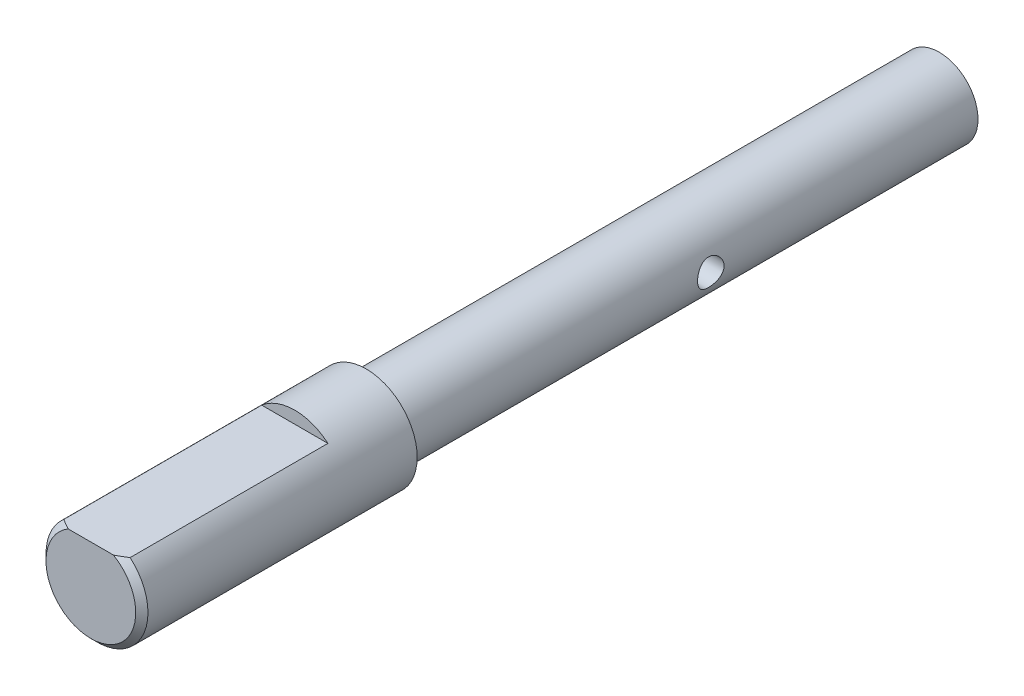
ISO-10303-21;
HEADER;
FILE_DESCRIPTION(('STEP AP214'),'2;1');
FILE_NAME('part.step','',(''),(''),'','','');
FILE_SCHEMA(('AUTOMOTIVE_DESIGN { 1 0 10303 214 1 1 1 1 }'));
ENDSEC;
DATA;
#1=APPLICATION_CONTEXT('core data for automotive mechanical design processes');
#2=APPLICATION_PROTOCOL_DEFINITION('international standard','automotive_design',2000,#1);
#3=PRODUCT_CONTEXT('',#1,'mechanical');
#4=PRODUCT('Part','Part','',(#3));
#5=PRODUCT_RELATED_PRODUCT_CATEGORY('part','',(#4));
#6=PRODUCT_DEFINITION_FORMATION('','',#4);
#7=PRODUCT_DEFINITION_CONTEXT('part definition',#1,'design');
#8=PRODUCT_DEFINITION('design','',#6,#7);
#9=PRODUCT_DEFINITION_SHAPE('','',#8);
#10=(LENGTH_UNIT() NAMED_UNIT(*) SI_UNIT(.MILLI.,.METRE.));
#11=(NAMED_UNIT(*) PLANE_ANGLE_UNIT() SI_UNIT($,.RADIAN.));
#12=(NAMED_UNIT(*) SI_UNIT($,.STERADIAN.) SOLID_ANGLE_UNIT());
#13=UNCERTAINTY_MEASURE_WITH_UNIT(LENGTH_MEASURE(1.E-05),#10,'distance_accuracy_value','');
#14=(GEOMETRIC_REPRESENTATION_CONTEXT(3) GLOBAL_UNCERTAINTY_ASSIGNED_CONTEXT((#13)) GLOBAL_UNIT_ASSIGNED_CONTEXT((#10,
#11,#12)) REPRESENTATION_CONTEXT('',''));
#15=CARTESIAN_POINT('',(0.,0.,0.));
#16=DIRECTION('',(0.,0.,1.));
#17=DIRECTION('',(1.,0.,0.));
#18=AXIS2_PLACEMENT_3D('',#15,#16,#17);
#19=CARTESIAN_POINT('',(0.,0.,71.374));
#20=DIRECTION('',(0.,0.,-1.));
#21=DIRECTION('',(-1.,0.,0.));
#22=AXIS2_PLACEMENT_3D('',#19,#20,#21);
#23=CYLINDRICAL_SURFACE('',#22,4.826);
#24=CARTESIAN_POINT('',(-4.826,0.,34.925));
#25=CARTESIAN_POINT('',(-4.82600061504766,-0.0899483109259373,34.9250009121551));
#26=CARTESIAN_POINT('',(-4.82346234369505,-0.179890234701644,34.9176255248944));
#27=CARTESIAN_POINT('',(-4.81358738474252,-0.357116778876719,34.8884149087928));
#28=CARTESIAN_POINT('',(-4.80625044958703,-0.444401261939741,34.8665789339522));
#29=CARTESIAN_POINT('',(-4.78757345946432,-0.61373237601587,34.8092889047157));
#30=CARTESIAN_POINT('',(-4.77624031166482,-0.695787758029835,34.7738583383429));
#31=CARTESIAN_POINT('',(-4.75072192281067,-0.852790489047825,34.6904937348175));
#32=CARTESIAN_POINT('',(-4.73653607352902,-0.92773631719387,34.6425570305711));
#33=CARTESIAN_POINT('',(-4.7062244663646,-1.07110916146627,34.5337179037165));
#34=CARTESIAN_POINT('',(-4.69005046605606,-1.13924314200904,34.4724429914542));
#35=CARTESIAN_POINT('',(-4.65784499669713,-1.26449445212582,34.3394584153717));
#36=CARTESIAN_POINT('',(-4.64181356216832,-1.32160917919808,34.2677462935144));
#37=CARTESIAN_POINT('',(-4.61117156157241,-1.42491105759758,34.1132398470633));
#38=CARTESIAN_POINT('',(-4.59661942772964,-1.47071069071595,34.0301737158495));
#39=CARTESIAN_POINT('',(-4.57132064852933,-1.54756344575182,33.8569398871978));
#40=CARTESIAN_POINT('',(-4.56057277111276,-1.57862134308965,33.7667745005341));
#41=CARTESIAN_POINT('',(-4.54460894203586,-1.62399794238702,33.5852435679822));
#42=CARTESIAN_POINT('',(-4.53921139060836,-1.63886797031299,33.4940322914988));
#43=CARTESIAN_POINT('',(-4.53402324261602,-1.65317049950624,33.3102619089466));
#44=CARTESIAN_POINT('',(-4.53423080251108,-1.65260807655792,33.2177032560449));
#45=CARTESIAN_POINT('',(-4.5400707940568,-1.63648839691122,33.0386330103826));
#46=CARTESIAN_POINT('',(-4.54543979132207,-1.62165927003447,32.9520457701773));
#47=CARTESIAN_POINT('',(-4.56056528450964,-1.57861815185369,32.7826717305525));
#48=CARTESIAN_POINT('',(-4.57032233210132,-1.55040447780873,32.6998854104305));
#49=CARTESIAN_POINT('',(-4.59330621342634,-1.48093449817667,32.5388437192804));
#50=CARTESIAN_POINT('',(-4.60658833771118,-1.43946799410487,32.4606872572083));
#51=CARTESIAN_POINT('',(-4.6351036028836,-1.34481540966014,32.3122155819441));
#52=CARTESIAN_POINT('',(-4.65033733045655,-1.29162580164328,32.2419027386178));
#53=CARTESIAN_POINT('',(-4.6820666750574,-1.17157328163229,32.1070343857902));
#54=CARTESIAN_POINT('',(-4.69858553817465,-1.1041178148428,32.0430106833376));
#55=CARTESIAN_POINT('',(-4.73029112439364,-0.959226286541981,31.927041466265));
#56=CARTESIAN_POINT('',(-4.74547770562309,-0.881789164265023,31.8750972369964));
#57=CARTESIAN_POINT('',(-4.77302589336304,-0.717958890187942,31.7843025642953));
#58=CARTESIAN_POINT('',(-4.78535478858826,-0.631477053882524,31.7456015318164));
#59=CARTESIAN_POINT('',(-4.80556014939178,-0.452706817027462,31.6834644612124));
#60=CARTESIAN_POINT('',(-4.81343824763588,-0.360420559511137,31.6600228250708));
#61=CARTESIAN_POINT('',(-4.82358054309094,-0.177158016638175,31.6300281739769));
#62=CARTESIAN_POINT('',(-4.82608325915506,-0.0863123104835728,31.6227570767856));
#63=CARTESIAN_POINT('',(-4.82591253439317,0.0953235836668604,31.6232552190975));
#64=CARTESIAN_POINT('',(-4.82324002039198,0.18611377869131,31.6310217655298));
#65=CARTESIAN_POINT('',(-4.81317669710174,0.362141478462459,31.6608105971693));
#66=CARTESIAN_POINT('',(-4.80593383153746,0.447463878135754,31.6823861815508));
#67=CARTESIAN_POINT('',(-4.78760639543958,0.613238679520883,31.7386162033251));
#68=CARTESIAN_POINT('',(-4.77652133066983,0.693690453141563,31.7732723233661));
#69=CARTESIAN_POINT('',(-4.75125571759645,0.849868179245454,31.8557147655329));
#70=CARTESIAN_POINT('',(-4.73699955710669,0.925407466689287,31.9038308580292));
#71=CARTESIAN_POINT('',(-4.70700095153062,1.06756980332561,32.011443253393));
#72=CARTESIAN_POINT('',(-4.691258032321,1.13418999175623,32.0709431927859));
#73=CARTESIAN_POINT('',(-4.65909969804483,1.25995369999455,32.2030079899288));
#74=CARTESIAN_POINT('',(-4.64268826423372,1.31858502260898,32.2760627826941));
#75=CARTESIAN_POINT('',(-4.61181134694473,1.42282719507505,32.4313223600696));
#76=CARTESIAN_POINT('',(-4.59734590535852,1.46843776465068,32.5135273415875));
#77=CARTESIAN_POINT('',(-4.57212804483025,1.54517326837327,32.6848977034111));
#78=CARTESIAN_POINT('',(-4.56137186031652,1.57631290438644,32.7740559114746));
#79=CARTESIAN_POINT('',(-4.54497823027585,1.62298264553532,32.9568076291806));
#80=CARTESIAN_POINT('',(-4.53933831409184,1.63852028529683,33.0503989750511));
#81=CARTESIAN_POINT('',(-4.53410665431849,1.6529384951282,33.2339178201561));
#82=CARTESIAN_POINT('',(-4.53420456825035,1.65267375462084,33.3237700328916));
#83=CARTESIAN_POINT('',(-4.53966446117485,1.63761572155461,33.5020773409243));
#84=CARTESIAN_POINT('',(-4.54502609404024,1.62282338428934,33.5905325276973));
#85=CARTESIAN_POINT('',(-4.56017235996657,1.57974835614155,33.7616699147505));
#86=CARTESIAN_POINT('',(-4.56986133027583,1.55175674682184,33.8444345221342));
#87=CARTESIAN_POINT('',(-4.59253082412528,1.48331722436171,34.0041538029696));
#88=CARTESIAN_POINT('',(-4.60551210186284,1.44286645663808,34.0811071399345));
#89=CARTESIAN_POINT('',(-4.63404007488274,1.34851021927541,34.2308190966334));
#90=CARTESIAN_POINT('',(-4.64967665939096,1.29407604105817,34.3032272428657));
#91=CARTESIAN_POINT('',(-4.68139155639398,1.17417636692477,34.438156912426));
#92=CARTESIAN_POINT('',(-4.69746999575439,1.10870767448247,34.5006755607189));
#93=CARTESIAN_POINT('',(-4.72906546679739,0.965308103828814,34.6166972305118));
#94=CARTESIAN_POINT('',(-4.74453079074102,0.886970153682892,34.6697130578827));
#95=CARTESIAN_POINT('',(-4.77242219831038,0.721976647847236,34.7617734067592));
#96=CARTESIAN_POINT('',(-4.78484886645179,0.635322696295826,34.8008206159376));
#97=CARTESIAN_POINT('',(-4.80496654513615,0.458546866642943,34.8627307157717));
#98=CARTESIAN_POINT('',(-4.81277674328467,0.368582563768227,34.8860034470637));
#99=CARTESIAN_POINT('',(-4.82329235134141,0.185742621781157,34.9171351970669));
#100=CARTESIAN_POINT('',(-4.82599936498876,0.0928679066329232,34.9249990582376));
#101=CARTESIAN_POINT('',(-4.826,0.,34.925));
#102=B_SPLINE_CURVE_WITH_KNOTS('',3,(#24,#25,#26,#27,#28,#29,#30,#31,#32,#33,#34,#35,#36,#37,
#38,#39,#40,#41,#42,#43,#44,#45,#46,#47,#48,#49,#50,#51,#52,#53,#54,#55,#56,#57,#58,#59,#60,#61,
#62,#63,#64,#65,#66,#67,#68,#69,#70,#71,#72,#73,#74,#75,#76,#77,#78,#79,#80,#81,#82,#83,#84,#85,
#86,#87,#88,#89,#90,#91,#92,#93,#94,#95,#96,#97,#98,#99,#100,#101),.UNSPECIFIED.,.T.,.F.,(4,2,2,
2,2,2,2,2,2,2,2,2,2,2,2,2,2,2,2,2,2,2,2,2,2,2,2,2,2,2,2,2,2,2,2,2,2,2,4),(0.,0.269503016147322,
0.539019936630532,0.808073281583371,1.07718405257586,1.35508842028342,1.6330583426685,
1.91952748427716,2.20590376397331,2.48218802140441,2.75838140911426,3.02118753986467,
3.28402672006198,3.55126085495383,3.8185755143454,4.10064112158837,4.38273672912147,
4.66791743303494,4.95299345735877,5.22513367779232,5.49722516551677,5.76093150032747,
6.02467176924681,6.29554519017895,6.56650528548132,6.8504680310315,7.13443688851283,
7.41811661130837,7.70165927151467,7.96988087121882,8.23808483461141,8.50063255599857,
8.76324047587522,9.03780411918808,9.31244743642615,9.59859216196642,9.88468180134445,
10.1630199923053,10.4412706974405),.UNSPECIFIED.);
#103=CARTESIAN_POINT('',(-4.826,0.,34.925));
#104=VERTEX_POINT('',#103);
#105=EDGE_CURVE('E43',#104,#104,#102,.T.);
#106=ORIENTED_EDGE('',*,*,#105,.T.);
#107=EDGE_LOOP('',(#106));
#108=FACE_BOUND('',#107,.T.);
#109=CARTESIAN_POINT('',(4.826,0.,31.623));
#110=CARTESIAN_POINT('',(4.82600061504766,-0.0899483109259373,31.6229990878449));
#111=CARTESIAN_POINT('',(4.82346234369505,-0.179890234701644,31.6303744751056));
#112=CARTESIAN_POINT('',(4.81358738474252,-0.357116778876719,31.6595850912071));
#113=CARTESIAN_POINT('',(4.80625044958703,-0.444401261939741,31.6814210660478));
#114=CARTESIAN_POINT('',(4.78757345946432,-0.61373237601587,31.7387110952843));
#115=CARTESIAN_POINT('',(4.77624031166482,-0.695787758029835,31.7741416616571));
#116=CARTESIAN_POINT('',(4.75072192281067,-0.852790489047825,31.8575062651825));
#117=CARTESIAN_POINT('',(4.73653607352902,-0.92773631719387,31.9054429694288));
#118=CARTESIAN_POINT('',(4.7062244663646,-1.07110916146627,32.0142820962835));
#119=CARTESIAN_POINT('',(4.69005046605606,-1.13924314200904,32.0755570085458));
#120=CARTESIAN_POINT('',(4.65784499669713,-1.26449445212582,32.2085415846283));
#121=CARTESIAN_POINT('',(4.64181356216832,-1.32160917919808,32.2802537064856));
#122=CARTESIAN_POINT('',(4.61117156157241,-1.42491105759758,32.4347601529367));
#123=CARTESIAN_POINT('',(4.59661942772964,-1.47071069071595,32.5178262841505));
#124=CARTESIAN_POINT('',(4.57132064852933,-1.54756344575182,32.6910601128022));
#125=CARTESIAN_POINT('',(4.56057277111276,-1.57862134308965,32.7812254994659));
#126=CARTESIAN_POINT('',(4.54460894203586,-1.62399794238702,32.9627564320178));
#127=CARTESIAN_POINT('',(4.53921139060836,-1.63886797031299,33.0539677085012));
#128=CARTESIAN_POINT('',(4.53402324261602,-1.65317049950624,33.2377380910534));
#129=CARTESIAN_POINT('',(4.53423080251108,-1.65260807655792,33.3302967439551));
#130=CARTESIAN_POINT('',(4.5400707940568,-1.63648839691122,33.5093669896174));
#131=CARTESIAN_POINT('',(4.54543979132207,-1.62165927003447,33.5959542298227));
#132=CARTESIAN_POINT('',(4.56056528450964,-1.57861815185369,33.7653282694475));
#133=CARTESIAN_POINT('',(4.57032233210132,-1.55040447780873,33.8481145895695));
#134=CARTESIAN_POINT('',(4.59330621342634,-1.48093449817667,34.0091562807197));
#135=CARTESIAN_POINT('',(4.60658833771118,-1.43946799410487,34.0873127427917));
#136=CARTESIAN_POINT('',(4.6351036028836,-1.34481540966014,34.2357844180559));
#137=CARTESIAN_POINT('',(4.65033733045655,-1.29162580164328,34.3060972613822));
#138=CARTESIAN_POINT('',(4.6820666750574,-1.17157328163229,34.4409656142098));
#139=CARTESIAN_POINT('',(4.69858553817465,-1.1041178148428,34.5049893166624));
#140=CARTESIAN_POINT('',(4.73029112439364,-0.959226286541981,34.620958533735));
#141=CARTESIAN_POINT('',(4.74547770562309,-0.881789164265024,34.6729027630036));
#142=CARTESIAN_POINT('',(4.77302589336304,-0.717958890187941,34.7636974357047));
#143=CARTESIAN_POINT('',(4.78535478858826,-0.631477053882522,34.8023984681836));
#144=CARTESIAN_POINT('',(4.80556014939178,-0.45270681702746,34.8645355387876));
#145=CARTESIAN_POINT('',(4.81343824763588,-0.360420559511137,34.8879771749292));
#146=CARTESIAN_POINT('',(4.82358054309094,-0.177158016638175,34.9179718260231));
#147=CARTESIAN_POINT('',(4.82608325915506,-0.0863123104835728,34.9252429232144));
#148=CARTESIAN_POINT('',(4.82591253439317,0.0953235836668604,34.9247447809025));
#149=CARTESIAN_POINT('',(4.82324002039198,0.18611377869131,34.9169782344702));
#150=CARTESIAN_POINT('',(4.81317669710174,0.362141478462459,34.8871894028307));
#151=CARTESIAN_POINT('',(4.80593383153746,0.447463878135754,34.8656138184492));
#152=CARTESIAN_POINT('',(4.78760639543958,0.613238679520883,34.8093837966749));
#153=CARTESIAN_POINT('',(4.77652133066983,0.693690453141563,34.7747276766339));
#154=CARTESIAN_POINT('',(4.75125571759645,0.849868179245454,34.6922852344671));
#155=CARTESIAN_POINT('',(4.73699955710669,0.925407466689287,34.6441691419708));
#156=CARTESIAN_POINT('',(4.70700095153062,1.06756980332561,34.536556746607));
#157=CARTESIAN_POINT('',(4.691258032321,1.13418999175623,34.4770568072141));
#158=CARTESIAN_POINT('',(4.65909969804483,1.25995369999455,34.3449920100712));
#159=CARTESIAN_POINT('',(4.64268826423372,1.31858502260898,34.2719372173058));
#160=CARTESIAN_POINT('',(4.61181134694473,1.42282719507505,34.1166776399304));
#161=CARTESIAN_POINT('',(4.59734590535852,1.46843776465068,34.0344726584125));
#162=CARTESIAN_POINT('',(4.57212804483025,1.54517326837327,33.8631022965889));
#163=CARTESIAN_POINT('',(4.56137186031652,1.57631290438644,33.7739440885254));
#164=CARTESIAN_POINT('',(4.54497823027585,1.62298264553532,33.5911923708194));
#165=CARTESIAN_POINT('',(4.53933831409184,1.63852028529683,33.4976010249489));
#166=CARTESIAN_POINT('',(4.53410665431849,1.6529384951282,33.3140821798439));
#167=CARTESIAN_POINT('',(4.53420456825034,1.65267375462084,33.2242299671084));
#168=CARTESIAN_POINT('',(4.53966446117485,1.63761572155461,33.0459226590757));
#169=CARTESIAN_POINT('',(4.54502609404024,1.62282338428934,32.9574674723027));
#170=CARTESIAN_POINT('',(4.56017235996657,1.57974835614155,32.7863300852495));
#171=CARTESIAN_POINT('',(4.56986133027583,1.55175674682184,32.7035654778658));
#172=CARTESIAN_POINT('',(4.59253082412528,1.48331722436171,32.5438461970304));
#173=CARTESIAN_POINT('',(4.60551210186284,1.44286645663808,32.4668928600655));
#174=CARTESIAN_POINT('',(4.63404007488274,1.34851021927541,32.3171809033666));
#175=CARTESIAN_POINT('',(4.64967665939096,1.29407604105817,32.2447727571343));
#176=CARTESIAN_POINT('',(4.68139155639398,1.17417636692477,32.109843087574));
#177=CARTESIAN_POINT('',(4.69746999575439,1.10870767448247,32.0473244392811));
#178=CARTESIAN_POINT('',(4.72906546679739,0.965308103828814,31.9313027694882));
#179=CARTESIAN_POINT('',(4.74453079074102,0.886970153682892,31.8782869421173));
#180=CARTESIAN_POINT('',(4.77242219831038,0.721976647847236,31.7862265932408));
#181=CARTESIAN_POINT('',(4.78484886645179,0.635322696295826,31.7471793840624));
#182=CARTESIAN_POINT('',(4.80496654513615,0.458546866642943,31.6852692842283));
#183=CARTESIAN_POINT('',(4.81277674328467,0.368582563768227,31.6619965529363));
#184=CARTESIAN_POINT('',(4.82329235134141,0.185742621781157,31.6308648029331));
#185=CARTESIAN_POINT('',(4.82599936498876,0.0928679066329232,31.6230009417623));
#186=CARTESIAN_POINT('',(4.826,0.,31.623));
#187=B_SPLINE_CURVE_WITH_KNOTS('',3,(#109,#110,#111,#112,#113,#114,#115,#116,#117,#118,#119,
#120,#121,#122,#123,#124,#125,#126,#127,#128,#129,#130,#131,#132,#133,#134,#135,#136,#137,#138,
#139,#140,#141,#142,#143,#144,#145,#146,#147,#148,#149,#150,#151,#152,#153,#154,#155,#156,#157,
#158,#159,#160,#161,#162,#163,#164,#165,#166,#167,#168,#169,#170,#171,#172,#173,#174,#175,#176,
#177,#178,#179,#180,#181,#182,#183,#184,#185,#186),.UNSPECIFIED.,.T.,.F.,(4,2,2,2,2,2,2,2,2,2,2,
2,2,2,2,2,2,2,2,2,2,2,2,2,2,2,2,2,2,2,2,2,2,2,2,2,2,2,4),(0.,0.269503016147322,
0.539019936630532,0.808073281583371,1.07718405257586,1.35508842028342,1.6330583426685,
1.91952748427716,2.20590376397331,2.48218802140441,2.75838140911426,3.02118753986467,
3.28402672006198,3.55126085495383,3.8185755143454,4.10064112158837,4.38273672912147,
4.66791743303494,4.95299345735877,5.22513367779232,5.49722516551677,5.76093150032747,
6.02467176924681,6.29554519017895,6.56650528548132,6.8504680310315,7.13443688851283,
7.41811661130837,7.70165927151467,7.9698808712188,8.23808483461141,8.50063255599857,
8.76324047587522,9.03780411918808,9.31244743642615,9.59859216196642,9.88468180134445,
10.1630199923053,10.4412706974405),.UNSPECIFIED.);
#188=CARTESIAN_POINT('',(4.826,0.,31.623));
#189=VERTEX_POINT('',#188);
#190=EDGE_CURVE('E132',#189,#189,#187,.T.);
#191=ORIENTED_EDGE('',*,*,#190,.T.);
#192=EDGE_LOOP('',(#191));
#193=FACE_BOUND('',#192,.T.);
#194=CARTESIAN_POINT('',(0.,0.,71.374));
#195=DIRECTION('',(0.,0.,1.));
#196=DIRECTION('',(1.,0.,0.));
#197=AXIS2_PLACEMENT_3D('',#194,#195,#196);
#198=CIRCLE('',#197,4.826);
#199=CARTESIAN_POINT('',(4.826,0.,71.374));
#200=VERTEX_POINT('',#199);
#201=EDGE_CURVE('E94',#200,#200,#198,.T.);
#202=ORIENTED_EDGE('',*,*,#201,.F.);
#203=EDGE_LOOP('',(#202));
#204=FACE_BOUND('',#203,.T.);
#205=CARTESIAN_POINT('',(0.,0.,0.));
#206=DIRECTION('',(0.,0.,1.));
#207=DIRECTION('',(1.,0.,0.));
#208=AXIS2_PLACEMENT_3D('',#205,#206,#207);
#209=CIRCLE('',#208,4.826);
#210=CARTESIAN_POINT('',(4.826,0.,0.));
#211=VERTEX_POINT('',#210);
#212=EDGE_CURVE('E100',#211,#211,#209,.T.);
#213=ORIENTED_EDGE('',*,*,#212,.T.);
#214=EDGE_LOOP('',(#213));
#215=FACE_BOUND('',#214,.T.);
#216=ADVANCED_FACE('F38',(#108,#193,#204,#215),#23,.T.);
#217=CARTESIAN_POINT('',(0.,0.,0.));
#218=DIRECTION('',(0.,0.,1.));
#219=DIRECTION('',(1.,0.,0.));
#220=AXIS2_PLACEMENT_3D('',#217,#218,#219);
#221=PLANE('',#220);
#222=ORIENTED_EDGE('',*,*,#212,.F.);
#223=EDGE_LOOP('',(#222));
#224=FACE_BOUND('',#223,.T.);
#225=ADVANCED_FACE('F124',(#224),#221,.F.);
#226=CARTESIAN_POINT('',(0.,0.,105.664));
#227=DIRECTION('',(0.,0.,-1.));
#228=DIRECTION('',(-1.,0.,0.));
#229=AXIS2_PLACEMENT_3D('',#226,#227,#228);
#230=CYLINDRICAL_SURFACE('',#229,6.35);
#231=CARTESIAN_POINT('',(0.,0.,104.902));
#232=DIRECTION('',(0.,0.,1.));
#233=DIRECTION('',(1.,0.,0.));
#234=AXIS2_PLACEMENT_3D('',#231,#232,#233);
#235=CIRCLE('',#234,6.35);
#236=CARTESIAN_POINT('',(4.12701150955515,4.826,104.902));
#237=VERTEX_POINT('',#236);
#238=CARTESIAN_POINT('',(-4.12701150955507,4.826,104.902));
#239=VERTEX_POINT('',#238);
#240=EDGE_CURVE('E93',#237,#239,#235,.F.);
#241=ORIENTED_EDGE('',*,*,#240,.T.);
#242=DIRECTION('',(0.,0.,-1.));
#243=VECTOR('',#242,1.);
#244=CARTESIAN_POINT('',(-4.12701150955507,4.826,105.664));
#245=LINE('',#244,#243);
#246=CARTESIAN_POINT('',(-4.12701150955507,4.826,80.264));
#247=VERTEX_POINT('',#246);
#248=EDGE_CURVE('E67',#239,#247,#245,.T.);
#249=ORIENTED_EDGE('',*,*,#248,.T.);
#250=CARTESIAN_POINT('',(0.,0.,80.264));
#251=DIRECTION('',(0.,0.,1.));
#252=DIRECTION('',(1.,0.,0.));
#253=AXIS2_PLACEMENT_3D('',#250,#251,#252);
#254=CIRCLE('',#253,6.35);
#255=CARTESIAN_POINT('',(4.12701150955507,4.826,80.264));
#256=VERTEX_POINT('',#255);
#257=EDGE_CURVE('E11',#256,#247,#254,.T.);
#258=ORIENTED_EDGE('',*,*,#257,.F.);
#259=DIRECTION('',(0.,0.,-1.));
#260=VECTOR('',#259,1.);
#261=CARTESIAN_POINT('',(4.12701150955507,4.826,105.664));
#262=LINE('',#261,#260);
#263=EDGE_CURVE('E152',#256,#237,#262,.F.);
#264=ORIENTED_EDGE('',*,*,#263,.T.);
#265=EDGE_LOOP('',(#241,#249,#258,#264));
#266=FACE_BOUND('',#265,.T.);
#267=CARTESIAN_POINT('',(0.,0.,71.374));
#268=DIRECTION('',(0.,0.,1.));
#269=DIRECTION('',(1.,0.,0.));
#270=AXIS2_PLACEMENT_3D('',#267,#268,#269);
#271=CIRCLE('',#270,6.35);
#272=CARTESIAN_POINT('',(6.35,0.,71.374));
#273=VERTEX_POINT('',#272);
#274=EDGE_CURVE('E158',#273,#273,#271,.T.);
#275=ORIENTED_EDGE('',*,*,#274,.T.);
#276=EDGE_LOOP('',(#275));
#277=FACE_BOUND('',#276,.T.);
#278=ADVANCED_FACE('F118',(#266,#277),#230,.T.);
#279=CARTESIAN_POINT('',(0.,0.,105.664));
#280=DIRECTION('',(0.,0.,1.));
#281=DIRECTION('',(1.,0.,0.));
#282=AXIS2_PLACEMENT_3D('',#279,#280,#281);
#283=PLANE('',#282);
#284=DIRECTION('',(1.,0.,0.));
#285=VECTOR('',#284,1.);
#286=CARTESIAN_POINT('',(-9.03825780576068,4.826,105.664));
#287=LINE('',#286,#285);
#288=CARTESIAN_POINT('',(-2.81699627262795,4.826,105.664));
#289=VERTEX_POINT('',#288);
#290=CARTESIAN_POINT('',(2.81699627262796,4.826,105.664));
#291=VERTEX_POINT('',#290);
#292=EDGE_CURVE('E61',#289,#291,#287,.T.);
#293=ORIENTED_EDGE('',*,*,#292,.F.);
#294=CARTESIAN_POINT('',(0.,0.,105.664));
#295=DIRECTION('',(0.,0.,1.));
#296=DIRECTION('',(1.,0.,0.));
#297=AXIS2_PLACEMENT_3D('',#294,#295,#296);
#298=CIRCLE('',#297,5.58799999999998);
#299=EDGE_CURVE('E88',#289,#291,#298,.T.);
#300=ORIENTED_EDGE('',*,*,#299,.T.);
#301=EDGE_LOOP('',(#293,#300));
#302=FACE_BOUND('',#301,.T.);
#303=ADVANCED_FACE('F87',(#302),#283,.T.);
#304=CARTESIAN_POINT('',(0.,0.,71.374));
#305=DIRECTION('',(0.,0.,1.));
#306=DIRECTION('',(1.,0.,0.));
#307=AXIS2_PLACEMENT_3D('',#304,#305,#306);
#308=PLANE('',#307);
#309=ORIENTED_EDGE('',*,*,#201,.T.);
#310=EDGE_LOOP('',(#309));
#311=FACE_BOUND('',#310,.T.);
#312=ORIENTED_EDGE('',*,*,#274,.F.);
#313=EDGE_LOOP('',(#312));
#314=FACE_BOUND('',#313,.T.);
#315=ADVANCED_FACE('F117',(#311,#314),#308,.F.);
#316=CARTESIAN_POINT('',(0.,0.,105.664));
#317=DIRECTION('',(0.,0.,-1.));
#318=DIRECTION('',(-1.,0.,0.));
#319=AXIS2_PLACEMENT_3D('',#316,#317,#318);
#320=CONICAL_SURFACE('',#319,5.58799999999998,0.785398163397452);
#321=CARTESIAN_POINT('',(-13.1247585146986,4.826,97.2680963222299));
#322=CARTESIAN_POINT('',(-12.9198151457,4.826,97.4604445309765));
#323=CARTESIAN_POINT('',(-12.7146079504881,4.826,97.6525118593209));
#324=CARTESIAN_POINT('',(-12.3035803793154,4.826,98.0359916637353));
#325=CARTESIAN_POINT('',(-12.0977599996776,4.826,98.2274041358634));
#326=CARTESIAN_POINT('',(-11.4789874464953,4.826,98.8007636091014));
#327=CARTESIAN_POINT('',(-11.0649890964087,4.826,99.1815832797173));
#328=CARTESIAN_POINT('',(-10.2235656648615,4.826,99.9479938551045));
#329=CARTESIAN_POINT('',(-9.7960527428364,4.826,100.333488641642));
#330=CARTESIAN_POINT('',(-9.15082284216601,4.826,100.90703835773));
#331=CARTESIAN_POINT('',(-8.93514592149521,4.826,101.097387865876));
#332=CARTESIAN_POINT('',(-8.50215733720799,4.826,101.476217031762));
#333=CARTESIAN_POINT('',(-8.28484568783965,4.826,101.664696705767));
#334=CARTESIAN_POINT('',(-7.84834390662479,4.826,102.039279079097));
#335=CARTESIAN_POINT('',(-7.62915462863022,4.826,102.22538277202));
#336=CARTESIAN_POINT('',(-7.18836317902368,4.826,102.594728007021));
#337=CARTESIAN_POINT('',(-6.96676094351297,4.826,102.777969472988));
#338=CARTESIAN_POINT('',(-6.52017907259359,4.826,103.14113815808));
#339=CARTESIAN_POINT('',(-6.29519402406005,4.826,103.321058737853));
#340=CARTESIAN_POINT('',(-5.84151410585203,4.826,103.676143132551));
#341=CARTESIAN_POINT('',(-5.61281951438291,4.826,103.851307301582));
#342=CARTESIAN_POINT('',(-5.15284847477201,4.826,104.193760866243));
#343=CARTESIAN_POINT('',(-4.92161511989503,4.826,104.361107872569));
#344=CARTESIAN_POINT('',(-4.45318037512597,4.826,104.687488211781));
#345=CARTESIAN_POINT('',(-4.21597684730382,4.826,104.84651850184));
#346=CARTESIAN_POINT('',(-3.73483629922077,4.826,105.152421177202));
#347=CARTESIAN_POINT('',(-3.49092265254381,4.826,105.299330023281));
#348=CARTESIAN_POINT('',(-2.99390091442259,4.826,105.576512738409));
#349=CARTESIAN_POINT('',(-2.74080187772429,4.826,105.70680244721));
#350=CARTESIAN_POINT('',(-2.3339916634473,4.826,105.892847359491));
#351=CARTESIAN_POINT('',(-2.18398404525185,4.826,105.956674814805));
#352=CARTESIAN_POINT('',(-1.8801176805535,4.826,106.074597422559));
#353=CARTESIAN_POINT('',(-1.72625836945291,4.826,106.128691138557));
#354=CARTESIAN_POINT('',(-1.41572064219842,4.826,106.22478497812));
#355=CARTESIAN_POINT('',(-1.25906329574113,4.826,106.266852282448));
#356=CARTESIAN_POINT('',(-0.942653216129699,4.826,106.337215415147));
#357=CARTESIAN_POINT('',(-0.782900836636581,4.826,106.36551280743));
#358=CARTESIAN_POINT('',(-0.459023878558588,4.826,106.406916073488));
#359=CARTESIAN_POINT('',(-0.294869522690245,4.826,106.419793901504));
#360=CARTESIAN_POINT('',(0.033885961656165,4.826,106.428678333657));
#361=CARTESIAN_POINT('',(0.198487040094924,4.826,106.424686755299));
#362=CARTESIAN_POINT('',(0.526956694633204,4.826,106.40008950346));
#363=CARTESIAN_POINT('',(0.690821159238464,4.826,106.379429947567));
#364=CARTESIAN_POINT('',(1.01588544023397,4.826,106.322837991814));
#365=CARTESIAN_POINT('',(1.1770844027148,4.826,106.28690079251));
#366=CARTESIAN_POINT('',(1.54832394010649,4.826,106.187822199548));
#367=CARTESIAN_POINT('',(1.75700331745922,4.826,106.119621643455));
#368=CARTESIAN_POINT('',(2.16747430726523,4.826,105.965039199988));
#369=CARTESIAN_POINT('',(2.36926219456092,4.826,105.878647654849));
#370=CARTESIAN_POINT('',(2.66816794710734,4.826,105.73823832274));
#371=CARTESIAN_POINT('',(2.76773585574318,4.826,105.689318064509));
#372=CARTESIAN_POINT('',(2.9653148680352,4.826,105.588419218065));
#373=CARTESIAN_POINT('',(3.06332595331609,4.826,105.536440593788));
#374=CARTESIAN_POINT('',(3.25785899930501,4.826,105.429861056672));
#375=CARTESIAN_POINT('',(3.354381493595,4.826,105.37526111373));
#376=CARTESIAN_POINT('',(3.54608294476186,4.826,105.263768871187));
#377=CARTESIAN_POINT('',(3.6412619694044,4.826,105.206876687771));
#378=CARTESIAN_POINT('',(3.96715797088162,4.826,105.007398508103));
#379=CARTESIAN_POINT('',(4.194848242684,4.826,104.859857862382));
#380=CARTESIAN_POINT('',(4.64445607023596,4.826,104.556193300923));
#381=CARTESIAN_POINT('',(4.8663718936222,4.826,104.400066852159));
#382=CARTESIAN_POINT('',(5.3057975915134,4.826,104.081303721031));
#383=CARTESIAN_POINT('',(5.52330285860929,4.826,103.918660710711));
#384=CARTESIAN_POINT('',(5.9545847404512,4.826,103.588572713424));
#385=CARTESIAN_POINT('',(6.1683617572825,4.826,103.421128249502));
#386=CARTESIAN_POINT('',(6.59382720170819,4.826,103.081791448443));
#387=CARTESIAN_POINT('',(6.80550299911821,4.826,102.909883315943));
#388=CARTESIAN_POINT('',(7.22640941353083,4.826,102.563095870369));
#389=CARTESIAN_POINT('',(7.43563997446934,4.826,102.388216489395));
#390=CARTESIAN_POINT('',(7.85196964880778,4.826,102.036178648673));
#391=CARTESIAN_POINT('',(8.05906989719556,4.826,101.859021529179));
#392=CARTESIAN_POINT('',(8.47159911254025,4.826,101.502770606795));
#393=CARTESIAN_POINT('',(8.67702806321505,4.826,101.323676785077));
#394=CARTESIAN_POINT('',(9.24300680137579,4.826,100.826378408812));
#395=CARTESIAN_POINT('',(9.60208220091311,4.826,100.506496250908));
#396=CARTESIAN_POINT('',(10.3170413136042,4.826,99.8630829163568));
#397=CARTESIAN_POINT('',(10.6729245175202,4.826,99.5395511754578));
#398=CARTESIAN_POINT('',(11.3792433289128,4.826,98.8924898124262));
#399=CARTESIAN_POINT('',(11.72969961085,4.826,98.5689827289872));
#400=CARTESIAN_POINT('',(12.428597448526,4.826,97.9199366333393));
#401=CARTESIAN_POINT('',(12.7770393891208,4.826,97.5943980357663));
#402=CARTESIAN_POINT('',(13.1247585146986,4.826,97.2680963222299));
#403=B_SPLINE_CURVE_WITH_KNOTS('',3,(#321,#322,#323,#324,#325,#326,#327,#328,#329,#330,#331,
#332,#333,#334,#335,#336,#337,#338,#339,#340,#341,#342,#343,#344,#345,#346,#347,#348,#349,#350,
#351,#352,#353,#354,#355,#356,#357,#358,#359,#360,#361,#362,#363,#364,#365,#366,#367,#368,#369,
#370,#371,#372,#373,#374,#375,#376,#377,#378,#379,#380,#381,#382,#383,#384,#385,#386,#387,#388,
#389,#390,#391,#392,#393,#394,#395,#396,#397,#398,#399,#400,#401,#402),.UNSPECIFIED.,.F.,.F.,(4,
2,2,2,2,2,2,2,2,2,2,2,2,2,2,2,2,2,2,2,2,2,2,2,2,2,2,2,2,2,2,2,2,2,2,2,2,2,2,2,4),(0.,
0.843205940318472,1.68641694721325,3.37393113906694,5.1008351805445,5.96381313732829,
6.82678358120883,7.68938047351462,8.55200026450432,9.41619012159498,10.2803154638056,
11.1364929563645,11.9929815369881,12.8467920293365,13.6997825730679,14.1885835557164,
14.6774566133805,15.1635428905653,15.6495739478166,16.1427076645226,16.6357882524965,
17.130469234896,17.6253057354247,18.2827855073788,18.9406152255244,19.2733837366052,
19.6061561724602,19.9388064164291,20.2714398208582,21.0850688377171,21.8989391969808,
22.7136199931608,23.528212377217,24.3462442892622,25.1642949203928,25.9818844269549,
26.7994818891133,28.2421285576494,29.6850014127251,31.115826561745,32.5463686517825),.UNSPECIFIED.);
#404=EDGE_CURVE('E53',#239,#289,#403,.T.);
#405=ORIENTED_EDGE('',*,*,#404,.F.);
#406=ORIENTED_EDGE('',*,*,#240,.F.);
#407=EDGE_CURVE('E83',#291,#237,#403,.T.);
#408=ORIENTED_EDGE('',*,*,#407,.F.);
#409=ORIENTED_EDGE('',*,*,#299,.F.);
#410=EDGE_LOOP('',(#405,#406,#408,#409));
#411=FACE_BOUND('',#410,.T.);
#412=ADVANCED_FACE('F40',(#411),#320,.T.);
#413=CARTESIAN_POINT('',(0.,0.,80.264));
#414=DIRECTION('',(0.,0.,1.));
#415=DIRECTION('',(1.,0.,0.));
#416=AXIS2_PLACEMENT_3D('',#413,#414,#415);
#417=PLANE('',#416);
#418=DIRECTION('',(1.,0.,0.));
#419=VECTOR('',#418,1.);
#420=CARTESIAN_POINT('',(-9.03825780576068,4.826,80.264));
#421=LINE('',#420,#419);
#422=EDGE_CURVE('E90',#247,#256,#421,.T.);
#423=ORIENTED_EDGE('',*,*,#422,.T.);
#424=ORIENTED_EDGE('',*,*,#257,.T.);
#425=EDGE_LOOP('',(#423,#424));
#426=FACE_BOUND('',#425,.T.);
#427=ADVANCED_FACE('F114',(#426),#417,.T.);
#428=CARTESIAN_POINT('',(-9.03825780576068,4.826,80.264));
#429=DIRECTION('',(0.,-1.,0.));
#430=DIRECTION('',(0.,0.,-1.));
#431=AXIS2_PLACEMENT_3D('',#428,#429,#430);
#432=PLANE('',#431);
#433=ORIENTED_EDGE('',*,*,#404,.T.);
#434=ORIENTED_EDGE('',*,*,#292,.T.);
#435=ORIENTED_EDGE('',*,*,#407,.T.);
#436=ORIENTED_EDGE('',*,*,#263,.F.);
#437=ORIENTED_EDGE('',*,*,#422,.F.);
#438=ORIENTED_EDGE('',*,*,#248,.F.);
#439=EDGE_LOOP('',(#433,#434,#435,#436,#437,#438));
#440=FACE_BOUND('',#439,.T.);
#441=ADVANCED_FACE('F77',(#440),#432,.F.);
#442=CARTESIAN_POINT('',(-6.35,0.,33.274));
#443=DIRECTION('',(1.,0.,0.));
#444=DIRECTION('',(0.,0.,-1.));
#445=AXIS2_PLACEMENT_3D('',#442,#443,#444);
#446=CYLINDRICAL_SURFACE('',#445,1.651);
#447=ORIENTED_EDGE('',*,*,#190,.F.);
#448=EDGE_LOOP('',(#447));
#449=FACE_BOUND('',#448,.T.);
#450=ORIENTED_EDGE('',*,*,#105,.F.);
#451=EDGE_LOOP('',(#450));
#452=FACE_BOUND('',#451,.T.);
#453=ADVANCED_FACE('F113',(#449,#452),#446,.F.);
#454=CLOSED_SHELL('',(#216,#225,#278,#303,#315,#412,#427,#441,#453));
#455=MANIFOLD_SOLID_BREP('B2',#454);
#456=ADVANCED_BREP_SHAPE_REPRESENTATION('',(#18,#455),#14);
#457=SHAPE_DEFINITION_REPRESENTATION(#9,#456);
ENDSEC;
END-ISO-10303-21;
